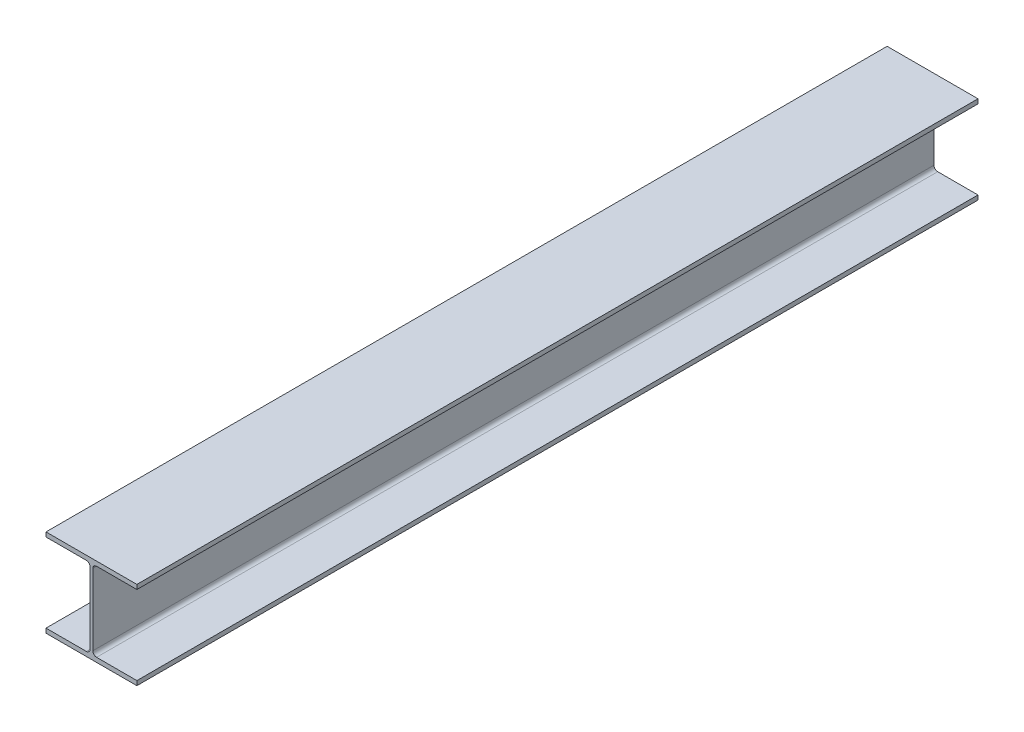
ISO-10303-21;
HEADER;
FILE_DESCRIPTION(('STEP AP214'),'2;1');
FILE_NAME('part.step','',(''),(''),'','','');
FILE_SCHEMA(('AUTOMOTIVE_DESIGN { 1 0 10303 214 1 1 1 1 }'));
ENDSEC;
DATA;
#1=APPLICATION_CONTEXT('core data for automotive mechanical design processes');
#2=APPLICATION_PROTOCOL_DEFINITION('international standard','automotive_design',2000,#1);
#3=PRODUCT_CONTEXT('',#1,'mechanical');
#4=PRODUCT('Part','Part','',(#3));
#5=PRODUCT_RELATED_PRODUCT_CATEGORY('part','',(#4));
#6=PRODUCT_DEFINITION_FORMATION('','',#4);
#7=PRODUCT_DEFINITION_CONTEXT('part definition',#1,'design');
#8=PRODUCT_DEFINITION('design','',#6,#7);
#9=PRODUCT_DEFINITION_SHAPE('','',#8);
#10=(LENGTH_UNIT() NAMED_UNIT(*) SI_UNIT(.MILLI.,.METRE.));
#11=(NAMED_UNIT(*) PLANE_ANGLE_UNIT() SI_UNIT($,.RADIAN.));
#12=(NAMED_UNIT(*) SI_UNIT($,.STERADIAN.) SOLID_ANGLE_UNIT());
#13=UNCERTAINTY_MEASURE_WITH_UNIT(LENGTH_MEASURE(1.E-05),#10,'distance_accuracy_value','');
#14=(GEOMETRIC_REPRESENTATION_CONTEXT(3) GLOBAL_UNCERTAINTY_ASSIGNED_CONTEXT((#13)) GLOBAL_UNIT_ASSIGNED_CONTEXT((#10,
#11,#12)) REPRESENTATION_CONTEXT('',''));
#15=CARTESIAN_POINT('',(0.,0.,0.));
#16=DIRECTION('',(0.,0.,1.));
#17=DIRECTION('',(1.,0.,0.));
#18=AXIS2_PLACEMENT_3D('',#15,#16,#17);
#19=CARTESIAN_POINT('',(184.404,-178.054,3413.125));
#20=DIRECTION('',(0.,1.,0.));
#21=DIRECTION('',(0.,0.,1.));
#22=AXIS2_PLACEMENT_3D('',#19,#20,#21);
#23=PLANE('',#22);
#24=DIRECTION('',(1.,0.,0.));
#25=VECTOR('',#24,1.);
#26=CARTESIAN_POINT('',(184.404,-178.054,0.));
#27=LINE('',#26,#25);
#28=CARTESIAN_POINT('',(-184.404,-178.054,0.));
#29=VERTEX_POINT('',#28);
#30=CARTESIAN_POINT('',(184.404,-178.054,0.));
#31=VERTEX_POINT('',#30);
#32=EDGE_CURVE('E179',#29,#31,#27,.T.);
#33=ORIENTED_EDGE('',*,*,#32,.T.);
#34=DIRECTION('',(0.,0.,-1.));
#35=VECTOR('',#34,1.);
#36=CARTESIAN_POINT('',(184.404,-178.054,3413.125));
#37=LINE('',#36,#35);
#38=CARTESIAN_POINT('',(184.404,-178.054,3413.125));
#39=VERTEX_POINT('',#38);
#40=EDGE_CURVE('E11',#39,#31,#37,.T.);
#41=ORIENTED_EDGE('',*,*,#40,.F.);
#42=DIRECTION('',(1.,0.,0.));
#43=VECTOR('',#42,1.);
#44=CARTESIAN_POINT('',(184.404,-178.054,3413.125));
#45=LINE('',#44,#43);
#46=CARTESIAN_POINT('',(-184.404,-178.054,3413.125));
#47=VERTEX_POINT('',#46);
#48=EDGE_CURVE('E209',#47,#39,#45,.T.);
#49=ORIENTED_EDGE('',*,*,#48,.F.);
#50=DIRECTION('',(0.,0.,-1.));
#51=VECTOR('',#50,1.);
#52=CARTESIAN_POINT('',(-184.404,-178.054,3413.125));
#53=LINE('',#52,#51);
#54=EDGE_CURVE('E175',#47,#29,#53,.T.);
#55=ORIENTED_EDGE('',*,*,#54,.T.);
#56=EDGE_LOOP('',(#33,#41,#49,#55));
#57=FACE_BOUND('',#56,.T.);
#58=ADVANCED_FACE('F35',(#57),#23,.F.);
#59=CARTESIAN_POINT('',(184.404,-160.02,3413.125));
#60=DIRECTION('',(-1.,0.,0.));
#61=DIRECTION('',(0.,0.,1.));
#62=AXIS2_PLACEMENT_3D('',#59,#60,#61);
#63=PLANE('',#62);
#64=DIRECTION('',(0.,1.,0.));
#65=VECTOR('',#64,1.);
#66=CARTESIAN_POINT('',(184.404,-160.02,0.));
#67=LINE('',#66,#65);
#68=CARTESIAN_POINT('',(184.404,-160.02,0.));
#69=VERTEX_POINT('',#68);
#70=EDGE_CURVE('E182',#31,#69,#67,.T.);
#71=ORIENTED_EDGE('',*,*,#70,.T.);
#72=DIRECTION('',(0.,0.,-1.));
#73=VECTOR('',#72,1.);
#74=CARTESIAN_POINT('',(184.404,-160.02,3413.125));
#75=LINE('',#74,#73);
#76=CARTESIAN_POINT('',(184.404,-160.02,3413.125));
#77=VERTEX_POINT('',#76);
#78=EDGE_CURVE('E43',#77,#69,#75,.T.);
#79=ORIENTED_EDGE('',*,*,#78,.F.);
#80=DIRECTION('',(0.,1.,0.));
#81=VECTOR('',#80,1.);
#82=CARTESIAN_POINT('',(184.404,-160.02,3413.125));
#83=LINE('',#82,#81);
#84=EDGE_CURVE('E118',#39,#77,#83,.T.);
#85=ORIENTED_EDGE('',*,*,#84,.F.);
#86=ORIENTED_EDGE('',*,*,#40,.T.);
#87=EDGE_LOOP('',(#71,#79,#85,#86));
#88=FACE_BOUND('',#87,.T.);
#89=ADVANCED_FACE('F307',(#88),#63,.F.);
#90=CARTESIAN_POINT('',(20.8280000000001,-160.02,3413.125));
#91=DIRECTION('',(0.,-1.,0.));
#92=DIRECTION('',(1.,0.,0.));
#93=AXIS2_PLACEMENT_3D('',#90,#91,#92);
#94=PLANE('',#93);
#95=DIRECTION('',(-1.,0.,0.));
#96=VECTOR('',#95,1.);
#97=CARTESIAN_POINT('',(20.8280000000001,-160.02,0.));
#98=LINE('',#97,#96);
#99=CARTESIAN_POINT('',(20.8280000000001,-160.02,0.));
#100=VERTEX_POINT('',#99);
#101=EDGE_CURVE('E184',#69,#100,#98,.T.);
#102=ORIENTED_EDGE('',*,*,#101,.T.);
#103=DIRECTION('',(0.,0.,-1.));
#104=VECTOR('',#103,1.);
#105=CARTESIAN_POINT('',(20.8280000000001,-160.02,3413.125));
#106=LINE('',#105,#104);
#107=CARTESIAN_POINT('',(20.8280000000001,-160.02,3413.125));
#108=VERTEX_POINT('',#107);
#109=EDGE_CURVE('E240',#108,#100,#106,.T.);
#110=ORIENTED_EDGE('',*,*,#109,.F.);
#111=DIRECTION('',(-1.,0.,0.));
#112=VECTOR('',#111,1.);
#113=CARTESIAN_POINT('',(20.8280000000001,-160.02,3413.125));
#114=LINE('',#113,#112);
#115=EDGE_CURVE('E248',#77,#108,#114,.T.);
#116=ORIENTED_EDGE('',*,*,#115,.F.);
#117=ORIENTED_EDGE('',*,*,#78,.T.);
#118=EDGE_LOOP('',(#102,#110,#116,#117));
#119=FACE_BOUND('',#118,.T.);
#120=ADVANCED_FACE('F246',(#119),#94,.F.);
#121=CARTESIAN_POINT('',(20.8280000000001,-144.78,3413.125));
#122=DIRECTION('',(0.,0.,-1.));
#123=DIRECTION('',(-1.,0.,0.));
#124=AXIS2_PLACEMENT_3D('',#121,#122,#123);
#125=CYLINDRICAL_SURFACE('',#124,15.2400000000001);
#126=CARTESIAN_POINT('',(20.8280000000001,-144.78,0.));
#127=DIRECTION('',(0.,0.,-1.));
#128=DIRECTION('',(1.,0.,0.));
#129=AXIS2_PLACEMENT_3D('',#126,#127,#128);
#130=CIRCLE('',#129,15.2400000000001);
#131=CARTESIAN_POINT('',(5.58799999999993,-144.78,0.));
#132=VERTEX_POINT('',#131);
#133=EDGE_CURVE('E186',#100,#132,#130,.T.);
#134=ORIENTED_EDGE('',*,*,#133,.T.);
#135=DIRECTION('',(0.,0.,-1.));
#136=VECTOR('',#135,1.);
#137=CARTESIAN_POINT('',(5.58799999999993,-144.78,3413.125));
#138=LINE('',#137,#136);
#139=CARTESIAN_POINT('',(5.58799999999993,-144.78,3413.125));
#140=VERTEX_POINT('',#139);
#141=EDGE_CURVE('E237',#140,#132,#138,.T.);
#142=ORIENTED_EDGE('',*,*,#141,.F.);
#143=CARTESIAN_POINT('',(20.8280000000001,-144.78,3413.125));
#144=DIRECTION('',(0.,0.,-1.));
#145=DIRECTION('',(1.,0.,0.));
#146=AXIS2_PLACEMENT_3D('',#143,#144,#145);
#147=CIRCLE('',#146,15.2400000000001);
#148=EDGE_CURVE('E266',#108,#140,#147,.T.);
#149=ORIENTED_EDGE('',*,*,#148,.F.);
#150=ORIENTED_EDGE('',*,*,#109,.T.);
#151=EDGE_LOOP('',(#134,#142,#149,#150));
#152=FACE_BOUND('',#151,.T.);
#153=ADVANCED_FACE('F257',(#152),#125,.F.);
#154=CARTESIAN_POINT('',(5.58799999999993,144.78,3413.125));
#155=DIRECTION('',(-1.,0.,0.));
#156=DIRECTION('',(0.,0.,1.));
#157=AXIS2_PLACEMENT_3D('',#154,#155,#156);
#158=PLANE('',#157);
#159=DIRECTION('',(0.,1.,0.));
#160=VECTOR('',#159,1.);
#161=CARTESIAN_POINT('',(5.58799999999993,144.78,0.));
#162=LINE('',#161,#160);
#163=CARTESIAN_POINT('',(5.58799999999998,144.78,0.));
#164=VERTEX_POINT('',#163);
#165=EDGE_CURVE('E188',#132,#164,#162,.T.);
#166=ORIENTED_EDGE('',*,*,#165,.T.);
#167=DIRECTION('',(0.,0.,-1.));
#168=VECTOR('',#167,1.);
#169=CARTESIAN_POINT('',(5.58799999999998,144.78,3413.125));
#170=LINE('',#169,#168);
#171=CARTESIAN_POINT('',(5.58799999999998,144.78,3413.125));
#172=VERTEX_POINT('',#171);
#173=EDGE_CURVE('E234',#172,#164,#170,.T.);
#174=ORIENTED_EDGE('',*,*,#173,.F.);
#175=DIRECTION('',(0.,1.,0.));
#176=VECTOR('',#175,1.);
#177=CARTESIAN_POINT('',(5.58799999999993,144.78,3413.125));
#178=LINE('',#177,#176);
#179=EDGE_CURVE('E263',#140,#172,#178,.T.);
#180=ORIENTED_EDGE('',*,*,#179,.F.);
#181=ORIENTED_EDGE('',*,*,#141,.T.);
#182=EDGE_LOOP('',(#166,#174,#180,#181));
#183=FACE_BOUND('',#182,.T.);
#184=ADVANCED_FACE('F261',(#183),#158,.F.);
#185=CARTESIAN_POINT('',(20.828,144.78,3413.125));
#186=DIRECTION('',(0.,0.,-1.));
#187=DIRECTION('',(-1.,0.,0.));
#188=AXIS2_PLACEMENT_3D('',#185,#186,#187);
#189=CYLINDRICAL_SURFACE('',#188,15.24);
#190=CARTESIAN_POINT('',(20.828,144.78,0.));
#191=DIRECTION('',(0.,0.,-1.));
#192=DIRECTION('',(1.,0.,0.));
#193=AXIS2_PLACEMENT_3D('',#190,#191,#192);
#194=CIRCLE('',#193,15.24);
#195=CARTESIAN_POINT('',(20.828,160.02,0.));
#196=VERTEX_POINT('',#195);
#197=EDGE_CURVE('E190',#164,#196,#194,.T.);
#198=ORIENTED_EDGE('',*,*,#197,.T.);
#199=DIRECTION('',(0.,0.,-1.));
#200=VECTOR('',#199,1.);
#201=CARTESIAN_POINT('',(20.828,160.02,3413.125));
#202=LINE('',#201,#200);
#203=CARTESIAN_POINT('',(20.828,160.02,3413.125));
#204=VERTEX_POINT('',#203);
#205=EDGE_CURVE('E231',#204,#196,#202,.T.);
#206=ORIENTED_EDGE('',*,*,#205,.F.);
#207=CARTESIAN_POINT('',(20.828,144.78,3413.125));
#208=DIRECTION('',(0.,0.,-1.));
#209=DIRECTION('',(1.,0.,0.));
#210=AXIS2_PLACEMENT_3D('',#207,#208,#209);
#211=CIRCLE('',#210,15.24);
#212=EDGE_CURVE('E265',#172,#204,#211,.T.);
#213=ORIENTED_EDGE('',*,*,#212,.F.);
#214=ORIENTED_EDGE('',*,*,#173,.T.);
#215=EDGE_LOOP('',(#198,#206,#213,#214));
#216=FACE_BOUND('',#215,.T.);
#217=ADVANCED_FACE('F320',(#216),#189,.F.);
#218=CARTESIAN_POINT('',(184.404,160.02,3413.125));
#219=DIRECTION('',(0.,1.,0.));
#220=DIRECTION('',(0.,0.,1.));
#221=AXIS2_PLACEMENT_3D('',#218,#219,#220);
#222=PLANE('',#221);
#223=DIRECTION('',(1.,0.,0.));
#224=VECTOR('',#223,1.);
#225=CARTESIAN_POINT('',(184.404,160.02,0.));
#226=LINE('',#225,#224);
#227=CARTESIAN_POINT('',(184.404,160.02,0.));
#228=VERTEX_POINT('',#227);
#229=EDGE_CURVE('E192',#196,#228,#226,.T.);
#230=ORIENTED_EDGE('',*,*,#229,.T.);
#231=DIRECTION('',(0.,0.,-1.));
#232=VECTOR('',#231,1.);
#233=CARTESIAN_POINT('',(184.404,160.02,3413.125));
#234=LINE('',#233,#232);
#235=CARTESIAN_POINT('',(184.404,160.02,3413.125));
#236=VERTEX_POINT('',#235);
#237=EDGE_CURVE('E228',#236,#228,#234,.T.);
#238=ORIENTED_EDGE('',*,*,#237,.F.);
#239=DIRECTION('',(1.,0.,0.));
#240=VECTOR('',#239,1.);
#241=CARTESIAN_POINT('',(184.404,160.02,3413.125));
#242=LINE('',#241,#240);
#243=EDGE_CURVE('E268',#204,#236,#242,.T.);
#244=ORIENTED_EDGE('',*,*,#243,.F.);
#245=ORIENTED_EDGE('',*,*,#205,.T.);
#246=EDGE_LOOP('',(#230,#238,#244,#245));
#247=FACE_BOUND('',#246,.T.);
#248=ADVANCED_FACE('F323',(#247),#222,.F.);
#249=CARTESIAN_POINT('',(184.404,178.054,3413.125));
#250=DIRECTION('',(-1.,0.,0.));
#251=DIRECTION('',(0.,-1.,0.));
#252=AXIS2_PLACEMENT_3D('',#249,#250,#251);
#253=PLANE('',#252);
#254=DIRECTION('',(0.,1.,0.));
#255=VECTOR('',#254,1.);
#256=CARTESIAN_POINT('',(184.404,178.054,0.));
#257=LINE('',#256,#255);
#258=CARTESIAN_POINT('',(184.404,178.054,0.));
#259=VERTEX_POINT('',#258);
#260=EDGE_CURVE('E194',#228,#259,#257,.T.);
#261=ORIENTED_EDGE('',*,*,#260,.T.);
#262=DIRECTION('',(0.,0.,-1.));
#263=VECTOR('',#262,1.);
#264=CARTESIAN_POINT('',(184.404,178.054,3413.125));
#265=LINE('',#264,#263);
#266=CARTESIAN_POINT('',(184.404,178.054,3413.125));
#267=VERTEX_POINT('',#266);
#268=EDGE_CURVE('E225',#267,#259,#265,.T.);
#269=ORIENTED_EDGE('',*,*,#268,.F.);
#270=DIRECTION('',(0.,1.,0.));
#271=VECTOR('',#270,1.);
#272=CARTESIAN_POINT('',(184.404,178.054,3413.125));
#273=LINE('',#272,#271);
#274=EDGE_CURVE('E274',#236,#267,#273,.T.);
#275=ORIENTED_EDGE('',*,*,#274,.F.);
#276=ORIENTED_EDGE('',*,*,#237,.T.);
#277=EDGE_LOOP('',(#261,#269,#275,#276));
#278=FACE_BOUND('',#277,.T.);
#279=ADVANCED_FACE('F327',(#278),#253,.F.);
#280=CARTESIAN_POINT('',(-184.404,178.054,3413.125));
#281=DIRECTION('',(0.,-1.,0.));
#282=DIRECTION('',(0.,0.,-1.));
#283=AXIS2_PLACEMENT_3D('',#280,#281,#282);
#284=PLANE('',#283);
#285=DIRECTION('',(-1.,0.,0.));
#286=VECTOR('',#285,1.);
#287=CARTESIAN_POINT('',(-184.404,178.054,0.));
#288=LINE('',#287,#286);
#289=CARTESIAN_POINT('',(-184.404,178.054,0.));
#290=VERTEX_POINT('',#289);
#291=EDGE_CURVE('E196',#259,#290,#288,.T.);
#292=ORIENTED_EDGE('',*,*,#291,.T.);
#293=DIRECTION('',(0.,0.,-1.));
#294=VECTOR('',#293,1.);
#295=CARTESIAN_POINT('',(-184.404,178.054,3413.125));
#296=LINE('',#295,#294);
#297=CARTESIAN_POINT('',(-184.404,178.054,3413.125));
#298=VERTEX_POINT('',#297);
#299=EDGE_CURVE('E222',#298,#290,#296,.T.);
#300=ORIENTED_EDGE('',*,*,#299,.F.);
#301=DIRECTION('',(-1.,0.,0.));
#302=VECTOR('',#301,1.);
#303=CARTESIAN_POINT('',(-184.404,178.054,3413.125));
#304=LINE('',#303,#302);
#305=EDGE_CURVE('E276',#267,#298,#304,.T.);
#306=ORIENTED_EDGE('',*,*,#305,.F.);
#307=ORIENTED_EDGE('',*,*,#268,.T.);
#308=EDGE_LOOP('',(#292,#300,#306,#307));
#309=FACE_BOUND('',#308,.T.);
#310=ADVANCED_FACE('F331',(#309),#284,.F.);
#311=CARTESIAN_POINT('',(-184.404,160.02,3413.125));
#312=DIRECTION('',(1.,0.,0.));
#313=DIRECTION('',(0.,0.,-1.));
#314=AXIS2_PLACEMENT_3D('',#311,#312,#313);
#315=PLANE('',#314);
#316=DIRECTION('',(0.,-1.,0.));
#317=VECTOR('',#316,1.);
#318=CARTESIAN_POINT('',(-184.404,160.02,0.));
#319=LINE('',#318,#317);
#320=CARTESIAN_POINT('',(-184.404,160.02,0.));
#321=VERTEX_POINT('',#320);
#322=EDGE_CURVE('E198',#290,#321,#319,.T.);
#323=ORIENTED_EDGE('',*,*,#322,.T.);
#324=DIRECTION('',(0.,0.,-1.));
#325=VECTOR('',#324,1.);
#326=CARTESIAN_POINT('',(-184.404,160.02,3413.125));
#327=LINE('',#326,#325);
#328=CARTESIAN_POINT('',(-184.404,160.02,3413.125));
#329=VERTEX_POINT('',#328);
#330=EDGE_CURVE('E219',#329,#321,#327,.T.);
#331=ORIENTED_EDGE('',*,*,#330,.F.);
#332=DIRECTION('',(0.,-1.,0.));
#333=VECTOR('',#332,1.);
#334=CARTESIAN_POINT('',(-184.404,160.02,3413.125));
#335=LINE('',#334,#333);
#336=EDGE_CURVE('E278',#298,#329,#335,.T.);
#337=ORIENTED_EDGE('',*,*,#336,.F.);
#338=ORIENTED_EDGE('',*,*,#299,.T.);
#339=EDGE_LOOP('',(#323,#331,#337,#338));
#340=FACE_BOUND('',#339,.T.);
#341=ADVANCED_FACE('F335',(#340),#315,.F.);
#342=CARTESIAN_POINT('',(-20.8280000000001,160.02,3413.125));
#343=DIRECTION('',(0.,1.,0.));
#344=DIRECTION('',(0.,0.,1.));
#345=AXIS2_PLACEMENT_3D('',#342,#343,#344);
#346=PLANE('',#345);
#347=DIRECTION('',(1.,0.,0.));
#348=VECTOR('',#347,1.);
#349=CARTESIAN_POINT('',(-20.8280000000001,160.02,0.));
#350=LINE('',#349,#348);
#351=CARTESIAN_POINT('',(-20.8280000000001,160.02,0.));
#352=VERTEX_POINT('',#351);
#353=EDGE_CURVE('E200',#321,#352,#350,.T.);
#354=ORIENTED_EDGE('',*,*,#353,.T.);
#355=DIRECTION('',(0.,0.,-1.));
#356=VECTOR('',#355,1.);
#357=CARTESIAN_POINT('',(-20.8280000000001,160.02,3413.125));
#358=LINE('',#357,#356);
#359=CARTESIAN_POINT('',(-20.8280000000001,160.02,3413.125));
#360=VERTEX_POINT('',#359);
#361=EDGE_CURVE('E216',#360,#352,#358,.T.);
#362=ORIENTED_EDGE('',*,*,#361,.F.);
#363=DIRECTION('',(1.,0.,0.));
#364=VECTOR('',#363,1.);
#365=CARTESIAN_POINT('',(-20.8280000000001,160.02,3413.125));
#366=LINE('',#365,#364);
#367=EDGE_CURVE('E280',#329,#360,#366,.T.);
#368=ORIENTED_EDGE('',*,*,#367,.F.);
#369=ORIENTED_EDGE('',*,*,#330,.T.);
#370=EDGE_LOOP('',(#354,#362,#368,#369));
#371=FACE_BOUND('',#370,.T.);
#372=ADVANCED_FACE('F339',(#371),#346,.F.);
#373=CARTESIAN_POINT('',(-20.8280000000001,144.78,3413.125));
#374=DIRECTION('',(0.,0.,-1.));
#375=DIRECTION('',(-1.,0.,0.));
#376=AXIS2_PLACEMENT_3D('',#373,#374,#375);
#377=CYLINDRICAL_SURFACE('',#376,15.24);
#378=CARTESIAN_POINT('',(-20.8280000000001,144.78,0.));
#379=DIRECTION('',(0.,0.,-1.));
#380=DIRECTION('',(1.,0.,0.));
#381=AXIS2_PLACEMENT_3D('',#378,#379,#380);
#382=CIRCLE('',#381,15.24);
#383=CARTESIAN_POINT('',(-5.58800000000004,144.78,0.));
#384=VERTEX_POINT('',#383);
#385=EDGE_CURVE('E202',#352,#384,#382,.T.);
#386=ORIENTED_EDGE('',*,*,#385,.T.);
#387=DIRECTION('',(0.,0.,-1.));
#388=VECTOR('',#387,1.);
#389=CARTESIAN_POINT('',(-5.58800000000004,144.78,3413.125));
#390=LINE('',#389,#388);
#391=CARTESIAN_POINT('',(-5.58800000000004,144.78,3413.125));
#392=VERTEX_POINT('',#391);
#393=EDGE_CURVE('E213',#392,#384,#390,.T.);
#394=ORIENTED_EDGE('',*,*,#393,.F.);
#395=CARTESIAN_POINT('',(-20.8280000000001,144.78,3413.125));
#396=DIRECTION('',(0.,0.,-1.));
#397=DIRECTION('',(1.,0.,0.));
#398=AXIS2_PLACEMENT_3D('',#395,#396,#397);
#399=CIRCLE('',#398,15.24);
#400=EDGE_CURVE('E282',#360,#392,#399,.T.);
#401=ORIENTED_EDGE('',*,*,#400,.F.);
#402=ORIENTED_EDGE('',*,*,#361,.T.);
#403=EDGE_LOOP('',(#386,#394,#401,#402));
#404=FACE_BOUND('',#403,.T.);
#405=ADVANCED_FACE('F288',(#404),#377,.F.);
#406=CARTESIAN_POINT('',(-5.58799999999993,-144.78,3413.125));
#407=DIRECTION('',(1.,0.,0.));
#408=DIRECTION('',(0.,1.,0.));
#409=AXIS2_PLACEMENT_3D('',#406,#407,#408);
#410=PLANE('',#409);
#411=DIRECTION('',(0.,-1.,0.));
#412=VECTOR('',#411,1.);
#413=CARTESIAN_POINT('',(-5.58799999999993,-144.78,0.));
#414=LINE('',#413,#412);
#415=CARTESIAN_POINT('',(-5.58799999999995,-144.78,0.));
#416=VERTEX_POINT('',#415);
#417=EDGE_CURVE('E204',#384,#416,#414,.T.);
#418=ORIENTED_EDGE('',*,*,#417,.T.);
#419=DIRECTION('',(0.,0.,-1.));
#420=VECTOR('',#419,1.);
#421=CARTESIAN_POINT('',(-5.58799999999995,-144.78,3413.125));
#422=LINE('',#421,#420);
#423=CARTESIAN_POINT('',(-5.58799999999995,-144.78,3413.125));
#424=VERTEX_POINT('',#423);
#425=EDGE_CURVE('E170',#424,#416,#422,.T.);
#426=ORIENTED_EDGE('',*,*,#425,.F.);
#427=DIRECTION('',(0.,-1.,0.));
#428=VECTOR('',#427,1.);
#429=CARTESIAN_POINT('',(-5.58799999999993,-144.78,3413.125));
#430=LINE('',#429,#428);
#431=EDGE_CURVE('E161',#392,#424,#430,.T.);
#432=ORIENTED_EDGE('',*,*,#431,.F.);
#433=ORIENTED_EDGE('',*,*,#393,.T.);
#434=EDGE_LOOP('',(#418,#426,#432,#433));
#435=FACE_BOUND('',#434,.T.);
#436=ADVANCED_FACE('F292',(#435),#410,.F.);
#437=CARTESIAN_POINT('',(-20.828,-144.78,3413.125));
#438=DIRECTION('',(0.,0.,-1.));
#439=DIRECTION('',(-1.,0.,0.));
#440=AXIS2_PLACEMENT_3D('',#437,#438,#439);
#441=CYLINDRICAL_SURFACE('',#440,15.24);
#442=CARTESIAN_POINT('',(-20.828,-144.78,0.));
#443=DIRECTION('',(0.,0.,-1.));
#444=DIRECTION('',(1.,0.,0.));
#445=AXIS2_PLACEMENT_3D('',#442,#443,#444);
#446=CIRCLE('',#445,15.24);
#447=CARTESIAN_POINT('',(-20.828,-160.02,0.));
#448=VERTEX_POINT('',#447);
#449=EDGE_CURVE('E169',#416,#448,#446,.T.);
#450=ORIENTED_EDGE('',*,*,#449,.T.);
#451=DIRECTION('',(0.,0.,-1.));
#452=VECTOR('',#451,1.);
#453=CARTESIAN_POINT('',(-20.828,-160.02,3413.125));
#454=LINE('',#453,#452);
#455=CARTESIAN_POINT('',(-20.828,-160.02,3413.125));
#456=VERTEX_POINT('',#455);
#457=EDGE_CURVE('E166',#456,#448,#454,.T.);
#458=ORIENTED_EDGE('',*,*,#457,.F.);
#459=CARTESIAN_POINT('',(-20.828,-144.78,3413.125));
#460=DIRECTION('',(0.,0.,-1.));
#461=DIRECTION('',(1.,0.,0.));
#462=AXIS2_PLACEMENT_3D('',#459,#460,#461);
#463=CIRCLE('',#462,15.24);
#464=EDGE_CURVE('E155',#424,#456,#463,.T.);
#465=ORIENTED_EDGE('',*,*,#464,.F.);
#466=ORIENTED_EDGE('',*,*,#425,.T.);
#467=EDGE_LOOP('',(#450,#458,#465,#466));
#468=FACE_BOUND('',#467,.T.);
#469=ADVANCED_FACE('F167',(#468),#441,.F.);
#470=CARTESIAN_POINT('',(-184.404,-160.02,3413.125));
#471=DIRECTION('',(0.,-1.,0.));
#472=DIRECTION('',(1.,0.,0.));
#473=AXIS2_PLACEMENT_3D('',#470,#471,#472);
#474=PLANE('',#473);
#475=DIRECTION('',(-1.,0.,0.));
#476=VECTOR('',#475,1.);
#477=CARTESIAN_POINT('',(-184.404,-160.02,0.));
#478=LINE('',#477,#476);
#479=CARTESIAN_POINT('',(-184.404,-160.02,0.));
#480=VERTEX_POINT('',#479);
#481=EDGE_CURVE('E104',#448,#480,#478,.T.);
#482=ORIENTED_EDGE('',*,*,#481,.T.);
#483=DIRECTION('',(0.,0.,-1.));
#484=VECTOR('',#483,1.);
#485=CARTESIAN_POINT('',(-184.404,-160.02,3413.125));
#486=LINE('',#485,#484);
#487=CARTESIAN_POINT('',(-184.404,-160.02,3413.125));
#488=VERTEX_POINT('',#487);
#489=EDGE_CURVE('E171',#488,#480,#486,.T.);
#490=ORIENTED_EDGE('',*,*,#489,.F.);
#491=DIRECTION('',(-1.,0.,0.));
#492=VECTOR('',#491,1.);
#493=CARTESIAN_POINT('',(-184.404,-160.02,3413.125));
#494=LINE('',#493,#492);
#495=EDGE_CURVE('E159',#456,#488,#494,.T.);
#496=ORIENTED_EDGE('',*,*,#495,.F.);
#497=ORIENTED_EDGE('',*,*,#457,.T.);
#498=EDGE_LOOP('',(#482,#490,#496,#497));
#499=FACE_BOUND('',#498,.T.);
#500=ADVANCED_FACE('F173',(#499),#474,.F.);
#501=CARTESIAN_POINT('',(-184.404,-178.054,3413.125));
#502=DIRECTION('',(1.,0.,0.));
#503=DIRECTION('',(0.,0.,-1.));
#504=AXIS2_PLACEMENT_3D('',#501,#502,#503);
#505=PLANE('',#504);
#506=DIRECTION('',(0.,-1.,0.));
#507=VECTOR('',#506,1.);
#508=CARTESIAN_POINT('',(-184.404,-178.054,0.));
#509=LINE('',#508,#507);
#510=EDGE_CURVE('E110',#480,#29,#509,.T.);
#511=ORIENTED_EDGE('',*,*,#510,.T.);
#512=ORIENTED_EDGE('',*,*,#54,.F.);
#513=DIRECTION('',(0.,-1.,0.));
#514=VECTOR('',#513,1.);
#515=CARTESIAN_POINT('',(-184.404,-178.054,3413.125));
#516=LINE('',#515,#514);
#517=EDGE_CURVE('E51',#488,#47,#516,.T.);
#518=ORIENTED_EDGE('',*,*,#517,.F.);
#519=ORIENTED_EDGE('',*,*,#489,.T.);
#520=EDGE_LOOP('',(#511,#512,#518,#519));
#521=FACE_BOUND('',#520,.T.);
#522=ADVANCED_FACE('F296',(#521),#505,.F.);
#523=CARTESIAN_POINT('',(-20.828,-144.78,3413.125));
#524=DIRECTION('',(0.,0.,1.));
#525=DIRECTION('',(1.,0.,0.));
#526=AXIS2_PLACEMENT_3D('',#523,#524,#525);
#527=PLANE('',#526);
#528=ORIENTED_EDGE('',*,*,#48,.T.);
#529=ORIENTED_EDGE('',*,*,#84,.T.);
#530=ORIENTED_EDGE('',*,*,#115,.T.);
#531=ORIENTED_EDGE('',*,*,#148,.T.);
#532=ORIENTED_EDGE('',*,*,#179,.T.);
#533=ORIENTED_EDGE('',*,*,#212,.T.);
#534=ORIENTED_EDGE('',*,*,#243,.T.);
#535=ORIENTED_EDGE('',*,*,#274,.T.);
#536=ORIENTED_EDGE('',*,*,#305,.T.);
#537=ORIENTED_EDGE('',*,*,#336,.T.);
#538=ORIENTED_EDGE('',*,*,#367,.T.);
#539=ORIENTED_EDGE('',*,*,#400,.T.);
#540=ORIENTED_EDGE('',*,*,#431,.T.);
#541=ORIENTED_EDGE('',*,*,#464,.T.);
#542=ORIENTED_EDGE('',*,*,#495,.T.);
#543=ORIENTED_EDGE('',*,*,#517,.T.);
#544=EDGE_LOOP('',(#528,#529,#530,#531,#532,#533,#534,#535,#536,#537,#538,#539,#540,#541,#542,#543));
#545=FACE_BOUND('',#544,.T.);
#546=ADVANCED_FACE('F157',(#545),#527,.T.);
#547=CARTESIAN_POINT('',(-20.828,-144.78,0.));
#548=DIRECTION('',(0.,0.,1.));
#549=DIRECTION('',(1.,0.,0.));
#550=AXIS2_PLACEMENT_3D('',#547,#548,#549);
#551=PLANE('',#550);
#552=ORIENTED_EDGE('',*,*,#32,.F.);
#553=ORIENTED_EDGE('',*,*,#510,.F.);
#554=ORIENTED_EDGE('',*,*,#481,.F.);
#555=ORIENTED_EDGE('',*,*,#449,.F.);
#556=ORIENTED_EDGE('',*,*,#417,.F.);
#557=ORIENTED_EDGE('',*,*,#385,.F.);
#558=ORIENTED_EDGE('',*,*,#353,.F.);
#559=ORIENTED_EDGE('',*,*,#322,.F.);
#560=ORIENTED_EDGE('',*,*,#291,.F.);
#561=ORIENTED_EDGE('',*,*,#260,.F.);
#562=ORIENTED_EDGE('',*,*,#229,.F.);
#563=ORIENTED_EDGE('',*,*,#197,.F.);
#564=ORIENTED_EDGE('',*,*,#165,.F.);
#565=ORIENTED_EDGE('',*,*,#133,.F.);
#566=ORIENTED_EDGE('',*,*,#101,.F.);
#567=ORIENTED_EDGE('',*,*,#70,.F.);
#568=EDGE_LOOP('',(#552,#553,#554,#555,#556,#557,#558,#559,#560,#561,#562,#563,#564,#565,#566,#567));
#569=FACE_BOUND('',#568,.T.);
#570=ADVANCED_FACE('F252',(#569),#551,.F.);
#571=CLOSED_SHELL('',(#58,#89,#120,#153,#184,#217,#248,#279,#310,#341,#372,#405,#436,#469,#500,
#522,#546,#570));
#572=MANIFOLD_SOLID_BREP('B2',#571);
#573=ADVANCED_BREP_SHAPE_REPRESENTATION('',(#18,#572),#14);
#574=SHAPE_DEFINITION_REPRESENTATION(#9,#573);
ENDSEC;
END-ISO-10303-21;
